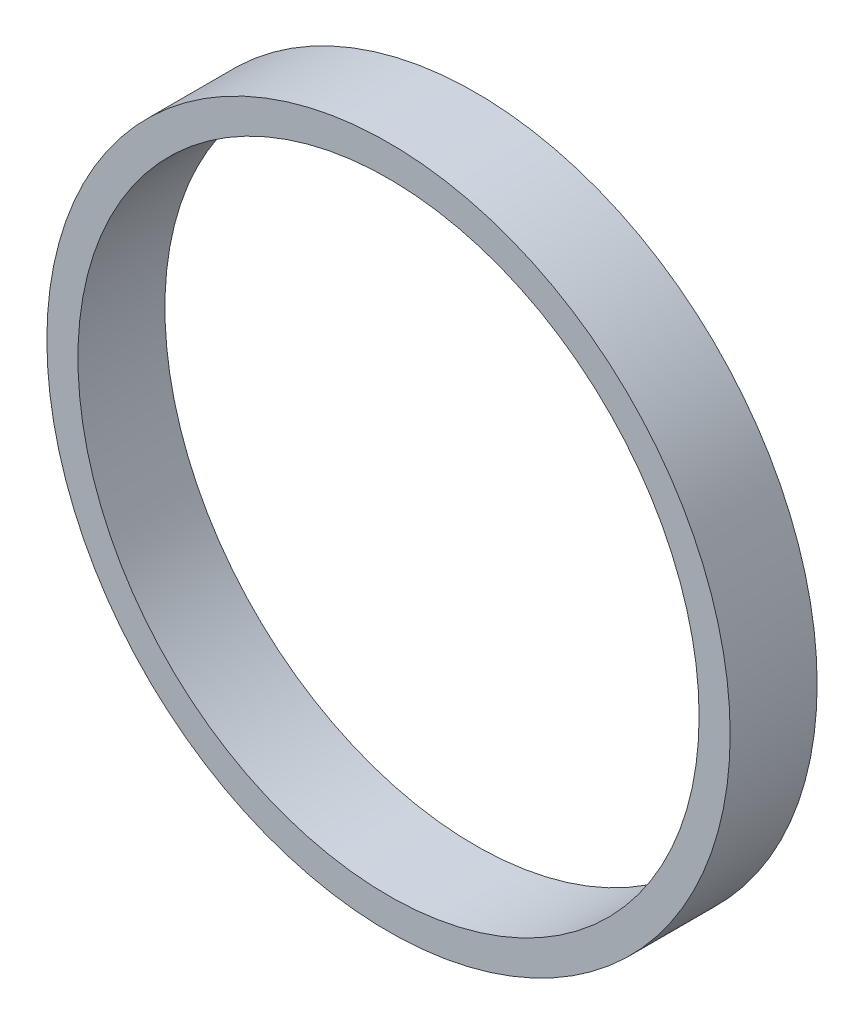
ISO-10303-21;
HEADER;
FILE_DESCRIPTION(('STEP AP214'),'2;1');
FILE_NAME('part.step','',(''),(''),'','','');
FILE_SCHEMA(('AUTOMOTIVE_DESIGN { 1 0 10303 214 1 1 1 1 }'));
ENDSEC;
DATA;
#1=APPLICATION_CONTEXT('core data for automotive mechanical design processes');
#2=APPLICATION_PROTOCOL_DEFINITION('international standard','automotive_design',2000,#1);
#3=PRODUCT_CONTEXT('',#1,'mechanical');
#4=PRODUCT('Part','Part','',(#3));
#5=PRODUCT_RELATED_PRODUCT_CATEGORY('part','',(#4));
#6=PRODUCT_DEFINITION_FORMATION('','',#4);
#7=PRODUCT_DEFINITION_CONTEXT('part definition',#1,'design');
#8=PRODUCT_DEFINITION('design','',#6,#7);
#9=PRODUCT_DEFINITION_SHAPE('','',#8);
#10=(LENGTH_UNIT() NAMED_UNIT(*) SI_UNIT(.MILLI.,.METRE.));
#11=(NAMED_UNIT(*) PLANE_ANGLE_UNIT() SI_UNIT($,.RADIAN.));
#12=(NAMED_UNIT(*) SI_UNIT($,.STERADIAN.) SOLID_ANGLE_UNIT());
#13=UNCERTAINTY_MEASURE_WITH_UNIT(LENGTH_MEASURE(1.E-05),#10,'distance_accuracy_value','');
#14=(GEOMETRIC_REPRESENTATION_CONTEXT(3) GLOBAL_UNCERTAINTY_ASSIGNED_CONTEXT((#13)) GLOBAL_UNIT_ASSIGNED_CONTEXT((#10,
#11,#12)) REPRESENTATION_CONTEXT('',''));
#15=CARTESIAN_POINT('',(0.,0.,0.));
#16=DIRECTION('',(0.,0.,1.));
#17=DIRECTION('',(1.,0.,0.));
#18=AXIS2_PLACEMENT_3D('',#15,#16,#17);
#19=CARTESIAN_POINT('',(0.,0.,14.));
#20=DIRECTION('',(0.,0.,1.));
#21=DIRECTION('',(1.,0.,0.));
#22=AXIS2_PLACEMENT_3D('',#19,#20,#21);
#23=PLANE('',#22);
#24=CARTESIAN_POINT('',(0.,0.,14.));
#25=DIRECTION('',(0.,0.,1.));
#26=DIRECTION('',(1.,0.,0.));
#27=AXIS2_PLACEMENT_3D('',#24,#25,#26);
#28=CIRCLE('',#27,55.);
#29=CARTESIAN_POINT('',(55.,0.,14.));
#30=VERTEX_POINT('',#29);
#31=EDGE_CURVE('E10',#30,#30,#28,.T.);
#32=ORIENTED_EDGE('',*,*,#31,.T.);
#33=EDGE_LOOP('',(#32));
#34=FACE_BOUND('',#33,.T.);
#35=CARTESIAN_POINT('',(0.,0.,14.));
#36=DIRECTION('',(0.,0.,1.));
#37=DIRECTION('',(1.,0.,0.));
#38=AXIS2_PLACEMENT_3D('',#35,#36,#37);
#39=CIRCLE('',#38,50.);
#40=CARTESIAN_POINT('',(50.,0.,14.));
#41=VERTEX_POINT('',#40);
#42=EDGE_CURVE('E41',#41,#41,#39,.T.);
#43=ORIENTED_EDGE('',*,*,#42,.F.);
#44=EDGE_LOOP('',(#43));
#45=FACE_BOUND('',#44,.T.);
#46=ADVANCED_FACE('F30',(#34,#45),#23,.T.);
#47=CARTESIAN_POINT('',(0.,0.,0.));
#48=DIRECTION('',(0.,0.,1.));
#49=DIRECTION('',(1.,0.,0.));
#50=AXIS2_PLACEMENT_3D('',#47,#48,#49);
#51=PLANE('',#50);
#52=CARTESIAN_POINT('',(0.,0.,0.));
#53=DIRECTION('',(0.,0.,1.));
#54=DIRECTION('',(1.,0.,0.));
#55=AXIS2_PLACEMENT_3D('',#52,#53,#54);
#56=CIRCLE('',#55,55.);
#57=CARTESIAN_POINT('',(55.,0.,0.));
#58=VERTEX_POINT('',#57);
#59=EDGE_CURVE('E34',#58,#58,#56,.T.);
#60=ORIENTED_EDGE('',*,*,#59,.F.);
#61=EDGE_LOOP('',(#60));
#62=FACE_BOUND('',#61,.T.);
#63=CARTESIAN_POINT('',(0.,0.,0.));
#64=DIRECTION('',(0.,0.,1.));
#65=DIRECTION('',(1.,0.,0.));
#66=AXIS2_PLACEMENT_3D('',#63,#64,#65);
#67=CIRCLE('',#66,50.);
#68=CARTESIAN_POINT('',(50.,0.,0.));
#69=VERTEX_POINT('',#68);
#70=EDGE_CURVE('E43',#69,#69,#67,.T.);
#71=ORIENTED_EDGE('',*,*,#70,.T.);
#72=EDGE_LOOP('',(#71));
#73=FACE_BOUND('',#72,.T.);
#74=ADVANCED_FACE('F53',(#62,#73),#51,.F.);
#75=CARTESIAN_POINT('',(0.,0.,14.));
#76=DIRECTION('',(0.,0.,-1.));
#77=DIRECTION('',(-1.,0.,0.));
#78=AXIS2_PLACEMENT_3D('',#75,#76,#77);
#79=CYLINDRICAL_SURFACE('',#78,55.);
#80=ORIENTED_EDGE('',*,*,#31,.F.);
#81=EDGE_LOOP('',(#80));
#82=FACE_BOUND('',#81,.T.);
#83=ORIENTED_EDGE('',*,*,#59,.T.);
#84=EDGE_LOOP('',(#83));
#85=FACE_BOUND('',#84,.T.);
#86=ADVANCED_FACE('F32',(#82,#85),#79,.T.);
#87=CARTESIAN_POINT('',(0.,0.,14.));
#88=DIRECTION('',(0.,0.,-1.));
#89=DIRECTION('',(-1.,0.,0.));
#90=AXIS2_PLACEMENT_3D('',#87,#88,#89);
#91=CYLINDRICAL_SURFACE('',#90,50.);
#92=ORIENTED_EDGE('',*,*,#42,.T.);
#93=EDGE_LOOP('',(#92));
#94=FACE_BOUND('',#93,.T.);
#95=ORIENTED_EDGE('',*,*,#70,.F.);
#96=EDGE_LOOP('',(#95));
#97=FACE_BOUND('',#96,.T.);
#98=ADVANCED_FACE('F49',(#94,#97),#91,.F.);
#99=CLOSED_SHELL('',(#46,#74,#86,#98));
#100=MANIFOLD_SOLID_BREP('B2',#99);
#101=ADVANCED_BREP_SHAPE_REPRESENTATION('',(#18,#100),#14);
#102=SHAPE_DEFINITION_REPRESENTATION(#9,#101);
ENDSEC;
END-ISO-10303-21;
